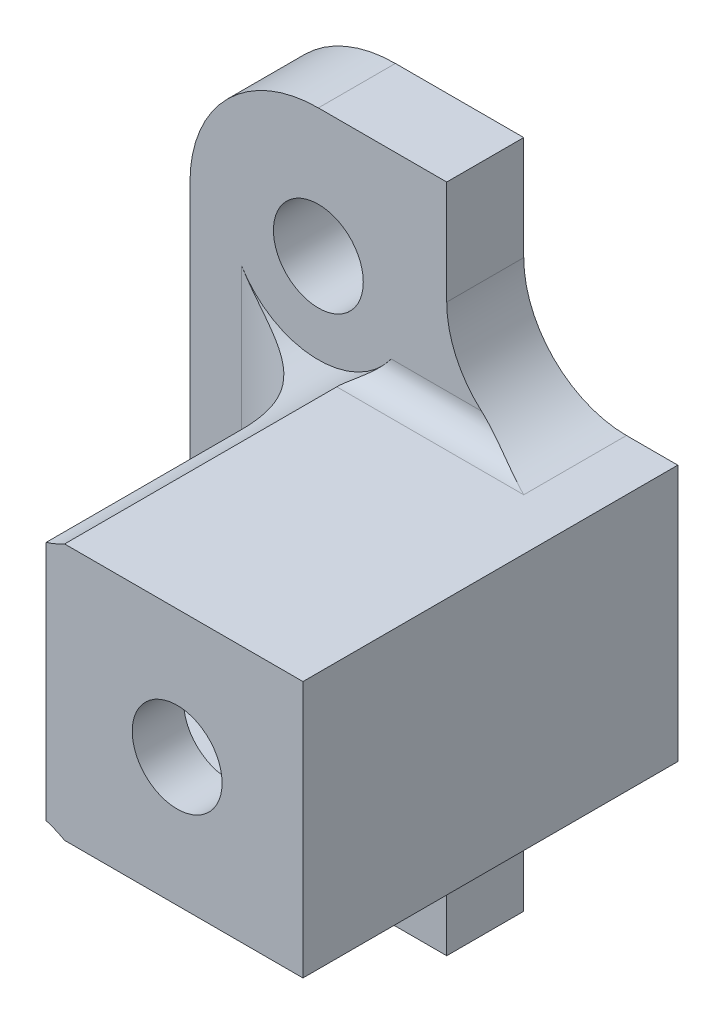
from build123d import *

# Parameters (mm, degrees)
SKETCH1_W                       = 10
SKETCH1_H                       = 26.1
SKETCH1_R                       = 1.75
BOSS_EXTRUDE1_DEPTH             = 3
FILLET1_R                       = 5
SKETCH2_W                       = 10
SKETCH2_H                       = 10
SKETCH2_W_2                     = 2
SKETCH2_H_2                     = 2
EXTRUDE_THIN1_DEPTH             = 11.6
EXTRUDE_THIN1_DIRECTION_2_REACH = 18.831
FILLET4_R                       = 1
SKETCH10_W                      = 10
SKETCH10_H                      = 10
BOSS_EXTRUDE4_DEPTH             = 7
SKETCH12_W                      = 8.4
SKETCH12_H                      = 5.8
CUT_EXTRUDE5_DEPTH              = 2.8
CUT_EXTRUDE3_REACH              = 25.755
SKETCH8_R                       = 3.5
SKETCH13_R                      = 1.75
CUT_EXTRUDE6_DEPTH              = 15.8
FILLET5_R                       = 4


with BuildPart() as part:
    # Sketch1 → Boss-Extrude1 (new body)
    with BuildSketch(Plane.XY):
        with Locations((-0.598290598, 2.536730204)):
            Rectangle(SKETCH1_W, SKETCH1_H)
        with Locations((-0.598290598, 10.586730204)):
            Circle(SKETCH1_R, mode=Mode.SUBTRACT)
        with Locations((-0.598290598, -5.513269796)):
            Circle(SKETCH1_R, mode=Mode.SUBTRACT)
    extrude(amount=BOSS_EXTRUDE1_DEPTH)

    # Fillet1
    fillet1_edges = [part.edges().sort_by_distance(p)[0] for p in [
        (-5.598290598, 15.586730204, 1.5),
        (-5.598290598, -10.513269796, 1.5),
    ]]
    fillet(fillet1_edges, radius=FILLET1_R)

    # Sketch2 → Extrude-Thin1 (add)
    with BuildSketch(Plane.XY.offset(3)):
        with Locations((5.401709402, 2.536730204)):
            Rectangle(SKETCH2_W, SKETCH2_H)
        with Locations((5.401709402, 2.536730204)):
            Rectangle(SKETCH2_W_2, SKETCH2_H_2, mode=Mode.SUBTRACT)
    extrude(amount=EXTRUDE_THIN1_DEPTH)

    # Extrude-Thin1 direction 2: up to this face of the body (flat: up to its plane)
    extrude_thin1_direction_2_end = Plane(part.part.faces().sort_by_distance((-0.417937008, 2.536730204, 0))[0])
    # Sketch2 → Extrude-Thin1 direction 2 (add, up to the picked face)
    with BuildSketch(Plane.XY.offset(3), mode=Mode.PRIVATE) as extrude_thin1_direction_2_sk1:
        with Locations((5.401709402, 2.536730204)):
            Rectangle(SKETCH2_W, SKETCH2_H)
        with Locations((5.401709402, 2.536730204)):
            Rectangle(SKETCH2_W_2, SKETCH2_H_2, mode=Mode.SUBTRACT)
    extrude_thin1_direction_2_tool1 = split(extrude(extrude_thin1_direction_2_sk1.sketch, amount=-EXTRUDE_THIN1_DIRECTION_2_REACH, mode=Mode.PRIVATE), bisect_by=extrude_thin1_direction_2_end, keep=Keep.BOTH, mode=Mode.PRIVATE)
    add(extrude_thin1_direction_2_tool1.solids().sort_by(Axis((5.401709, -2.321848, 3), (0, 0, -1)))[0])

    # Fillet4
    fillet4_edges = [part.edges().sort_by_distance(p)[0] for p in [
        (2.401709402, -2.463269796, 3),
        (2.401709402, 7.536730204, 3),
    ]]
    fillet(fillet4_edges, radius=FILLET4_R)

    # Sketch10 → Boss-Extrude4 (add)
    with BuildSketch(Plane.XY.offset(14.6)):
        with Locations((5.401709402, 2.536730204)):
            Rectangle(SKETCH10_W, SKETCH10_H)
    extrude(amount=-BOSS_EXTRUDE4_DEPTH)

    # Sketch12 → Cut-Extrude5 (cut)
    with BuildSketch(Plane.XY.offset(12.6)):
        with Locations((4.601709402, 2.536730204)):
            Rectangle(SKETCH12_W, SKETCH12_H)
    extrude(amount=-CUT_EXTRUDE5_DEPTH, mode=Mode.SUBTRACT)

    # Cut-Extrude3: up to this face of the body (flat: up to its plane)
    cut_extrude3_end = Plane(part.part.faces().sort_by_distance((-1.157404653, 2.536730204, 3))[0])
    # Sketch8 → Cut-Extrude3 (cut, up to the picked face)
    with BuildSketch(Plane.XY.offset(14.6), mode=Mode.PRIVATE) as cut_extrude3_sk1:
        with Locations((-0.598290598, 10.586730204)):
            Circle(SKETCH8_R)
    cut_extrude3_tool1 = split(extrude(cut_extrude3_sk1.sketch, amount=-CUT_EXTRUDE3_REACH, mode=Mode.PRIVATE), bisect_by=cut_extrude3_end, keep=Keep.BOTH, mode=Mode.PRIVATE)
    # Sketch8 → Cut-Extrude3 (cut, up to the picked face)
    with BuildSketch(Plane.XY.offset(14.6), mode=Mode.PRIVATE) as cut_extrude3_sk2:
        with Locations((-0.598290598, -5.513269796)):
            Circle(SKETCH8_R)
    cut_extrude3_tool2 = split(extrude(cut_extrude3_sk2.sketch, amount=-CUT_EXTRUDE3_REACH, mode=Mode.PRIVATE), bisect_by=cut_extrude3_end, keep=Keep.BOTH, mode=Mode.PRIVATE)
    add(cut_extrude3_tool1.solids().sort_by(Axis((-0.598291, 10.58673, 14.6), (0, 0, -1)))[0], mode=Mode.SUBTRACT)
    add(cut_extrude3_tool2.solids().sort_by(Axis((-0.598291, -5.51327, 14.6), (0, 0, -1)))[0], mode=Mode.SUBTRACT)

    # Sketch13 → Cut-Extrude6 (cut)
    with BuildSketch(Plane.XY.offset(14.6)):
        with Locations((5.501709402, 2.536730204)):
            Circle(SKETCH13_R)
    extrude(amount=-CUT_EXTRUDE6_DEPTH, mode=Mode.SUBTRACT)

    # Fillet5
    fillet5_edges = [part.edges().sort_by_distance(p)[0] for p in [
        (4.401709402, -2.463269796, 2),
        (4.401709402, 7.536730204, 2),
        (0.401709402, 2.536730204, 3),
    ]]
    fillet(fillet5_edges, radius=FILLET5_R)


solid = part.part
